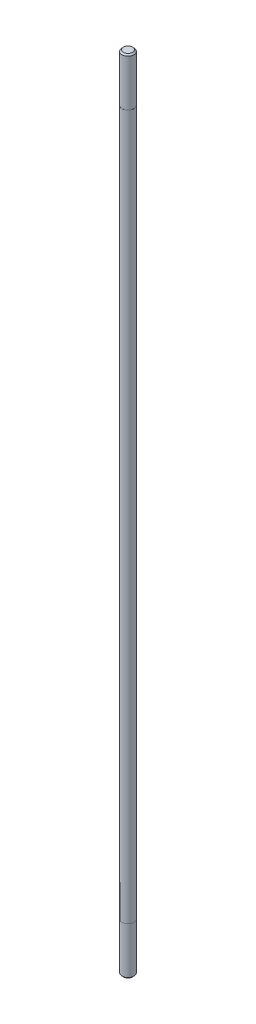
ISO-10303-21;
HEADER;
FILE_DESCRIPTION(('STEP AP214'),'2;1');
FILE_NAME('part.step','',(''),(''),'','','');
FILE_SCHEMA(('AUTOMOTIVE_DESIGN { 1 0 10303 214 1 1 1 1 }'));
ENDSEC;
DATA;
#1=APPLICATION_CONTEXT('core data for automotive mechanical design processes');
#2=APPLICATION_PROTOCOL_DEFINITION('international standard','automotive_design',2000,#1);
#3=PRODUCT_CONTEXT('',#1,'mechanical');
#4=PRODUCT('Part','Part','',(#3));
#5=PRODUCT_RELATED_PRODUCT_CATEGORY('part','',(#4));
#6=PRODUCT_DEFINITION_FORMATION('','',#4);
#7=PRODUCT_DEFINITION_CONTEXT('part definition',#1,'design');
#8=PRODUCT_DEFINITION('design','',#6,#7);
#9=PRODUCT_DEFINITION_SHAPE('','',#8);
#10=(LENGTH_UNIT() NAMED_UNIT(*) SI_UNIT(.MILLI.,.METRE.));
#11=(NAMED_UNIT(*) PLANE_ANGLE_UNIT() SI_UNIT($,.RADIAN.));
#12=(NAMED_UNIT(*) SI_UNIT($,.STERADIAN.) SOLID_ANGLE_UNIT());
#13=UNCERTAINTY_MEASURE_WITH_UNIT(LENGTH_MEASURE(1.E-05),#10,'distance_accuracy_value','');
#14=(GEOMETRIC_REPRESENTATION_CONTEXT(3) GLOBAL_UNCERTAINTY_ASSIGNED_CONTEXT((#13)) GLOBAL_UNIT_ASSIGNED_CONTEXT((#10,
#11,#12)) REPRESENTATION_CONTEXT('',''));
#15=CARTESIAN_POINT('',(0.,0.,0.));
#16=DIRECTION('',(0.,0.,1.));
#17=DIRECTION('',(1.,0.,0.));
#18=AXIS2_PLACEMENT_3D('',#15,#16,#17);
#19=CARTESIAN_POINT('',(0.,0.,0.));
#20=DIRECTION('',(0.,1.,0.));
#21=DIRECTION('',(0.,0.,1.));
#22=AXIS2_PLACEMENT_3D('',#19,#20,#21);
#23=PLANE('',#22);
#24=CARTESIAN_POINT('',(0.,0.,0.));
#25=DIRECTION('',(0.,1.,0.));
#26=DIRECTION('',(0.,0.,1.));
#27=AXIS2_PLACEMENT_3D('',#24,#25,#26);
#28=CIRCLE('',#27,1.5);
#29=CARTESIAN_POINT('',(0.,0.,1.5));
#30=VERTEX_POINT('',#29);
#31=EDGE_CURVE('E56',#30,#30,#28,.T.);
#32=ORIENTED_EDGE('',*,*,#31,.F.);
#33=EDGE_LOOP('',(#32));
#34=FACE_BOUND('',#33,.T.);
#35=CARTESIAN_POINT('',(0.,0.,0.));
#36=DIRECTION('',(0.,1.,0.));
#37=DIRECTION('',(0.,0.,1.));
#38=AXIS2_PLACEMENT_3D('',#35,#36,#37);
#39=CIRCLE('',#38,1.49);
#40=CARTESIAN_POINT('',(0.,0.,1.49));
#41=VERTEX_POINT('',#40);
#42=EDGE_CURVE('E50',#41,#41,#39,.F.);
#43=ORIENTED_EDGE('',*,*,#42,.F.);
#44=EDGE_LOOP('',(#43));
#45=FACE_BOUND('',#44,.T.);
#46=ADVANCED_FACE('F30',(#34,#45),#23,.F.);
#47=CARTESIAN_POINT('',(0.,176.,0.));
#48=DIRECTION('',(0.,1.,0.));
#49=DIRECTION('',(0.,0.,1.));
#50=AXIS2_PLACEMENT_3D('',#47,#48,#49);
#51=PLANE('',#50);
#52=CARTESIAN_POINT('',(0.,176.,0.));
#53=DIRECTION('',(0.,1.,0.));
#54=DIRECTION('',(0.,0.,1.));
#55=AXIS2_PLACEMENT_3D('',#52,#53,#54);
#56=CIRCLE('',#55,1.5);
#57=CARTESIAN_POINT('',(0.,176.,1.5));
#58=VERTEX_POINT('',#57);
#59=EDGE_CURVE('E53',#58,#58,#56,.T.);
#60=ORIENTED_EDGE('',*,*,#59,.T.);
#61=EDGE_LOOP('',(#60));
#62=FACE_BOUND('',#61,.T.);
#63=CARTESIAN_POINT('',(0.,176.,0.));
#64=DIRECTION('',(0.,1.,0.));
#65=DIRECTION('',(0.,0.,1.));
#66=AXIS2_PLACEMENT_3D('',#63,#64,#65);
#67=CIRCLE('',#66,1.49);
#68=CARTESIAN_POINT('',(0.,176.,1.49));
#69=VERTEX_POINT('',#68);
#70=EDGE_CURVE('E59',#69,#69,#67,.T.);
#71=ORIENTED_EDGE('',*,*,#70,.F.);
#72=EDGE_LOOP('',(#71));
#73=FACE_BOUND('',#72,.T.);
#74=ADVANCED_FACE('F65',(#62,#73),#51,.T.);
#75=CARTESIAN_POINT('',(0.,176.,0.));
#76=DIRECTION('',(0.,-1.,0.));
#77=DIRECTION('',(0.,0.,-1.));
#78=AXIS2_PLACEMENT_3D('',#75,#76,#77);
#79=CYLINDRICAL_SURFACE('',#78,1.5);
#80=ORIENTED_EDGE('',*,*,#59,.F.);
#81=EDGE_LOOP('',(#80));
#82=FACE_BOUND('',#81,.T.);
#83=ORIENTED_EDGE('',*,*,#31,.T.);
#84=EDGE_LOOP('',(#83));
#85=FACE_BOUND('',#84,.T.);
#86=ADVANCED_FACE('F32',(#82,#85),#79,.T.);
#87=CARTESIAN_POINT('',(0.,188.,0.));
#88=DIRECTION('',(0.,-1.,0.));
#89=DIRECTION('',(0.,0.,-1.));
#90=AXIS2_PLACEMENT_3D('',#87,#88,#89);
#91=CYLINDRICAL_SURFACE('',#90,1.49);
#92=CARTESIAN_POINT('',(0.,187.65,0.));
#93=DIRECTION('',(0.,1.,0.));
#94=DIRECTION('',(0.,0.,1.));
#95=AXIS2_PLACEMENT_3D('',#92,#93,#94);
#96=CIRCLE('',#95,1.49);
#97=CARTESIAN_POINT('',(0.,187.65,1.49));
#98=VERTEX_POINT('',#97);
#99=EDGE_CURVE('E41',#98,#98,#96,.F.);
#100=ORIENTED_EDGE('',*,*,#99,.T.);
#101=EDGE_LOOP('',(#100));
#102=FACE_BOUND('',#101,.T.);
#103=ORIENTED_EDGE('',*,*,#70,.T.);
#104=EDGE_LOOP('',(#103));
#105=FACE_BOUND('',#104,.T.);
#106=ADVANCED_FACE('F63',(#102,#105),#91,.T.);
#107=CARTESIAN_POINT('',(0.,188.,0.));
#108=DIRECTION('',(0.,1.,0.));
#109=DIRECTION('',(0.,0.,1.));
#110=AXIS2_PLACEMENT_3D('',#107,#108,#109);
#111=PLANE('',#110);
#112=CARTESIAN_POINT('',(0.,188.,0.));
#113=DIRECTION('',(0.,1.,0.));
#114=DIRECTION('',(0.,0.,1.));
#115=AXIS2_PLACEMENT_3D('',#112,#113,#114);
#116=CIRCLE('',#115,1.14);
#117=CARTESIAN_POINT('',(0.,188.,1.14));
#118=VERTEX_POINT('',#117);
#119=EDGE_CURVE('E45',#118,#118,#116,.T.);
#120=ORIENTED_EDGE('',*,*,#119,.T.);
#121=EDGE_LOOP('',(#120));
#122=FACE_BOUND('',#121,.T.);
#123=ADVANCED_FACE('F78',(#122),#111,.T.);
#124=CARTESIAN_POINT('',(0.,-12.,0.));
#125=DIRECTION('',(0.,1.,0.));
#126=DIRECTION('',(0.,0.,1.));
#127=AXIS2_PLACEMENT_3D('',#124,#125,#126);
#128=CYLINDRICAL_SURFACE('',#127,1.49);
#129=CARTESIAN_POINT('',(0.,-11.65,0.));
#130=DIRECTION('',(0.,-1.,0.));
#131=DIRECTION('',(0.,0.,-1.));
#132=AXIS2_PLACEMENT_3D('',#129,#130,#131);
#133=CIRCLE('',#132,1.49);
#134=CARTESIAN_POINT('',(0.,-11.65,-1.49));
#135=VERTEX_POINT('',#134);
#136=EDGE_CURVE('E10',#135,#135,#133,.F.);
#137=ORIENTED_EDGE('',*,*,#136,.T.);
#138=EDGE_LOOP('',(#137));
#139=FACE_BOUND('',#138,.T.);
#140=ORIENTED_EDGE('',*,*,#42,.T.);
#141=EDGE_LOOP('',(#140));
#142=FACE_BOUND('',#141,.T.);
#143=ADVANCED_FACE('F82',(#139,#142),#128,.T.);
#144=CARTESIAN_POINT('',(0.,-12.,0.));
#145=DIRECTION('',(0.,-1.,0.));
#146=DIRECTION('',(0.,0.,-1.));
#147=AXIS2_PLACEMENT_3D('',#144,#145,#146);
#148=PLANE('',#147);
#149=CARTESIAN_POINT('',(0.,-12.,0.));
#150=DIRECTION('',(0.,-1.,0.));
#151=DIRECTION('',(0.,0.,-1.));
#152=AXIS2_PLACEMENT_3D('',#149,#150,#151);
#153=CIRCLE('',#152,1.13999999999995);
#154=CARTESIAN_POINT('',(0.,-12.,-1.13999999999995));
#155=VERTEX_POINT('',#154);
#156=EDGE_CURVE('E37',#155,#155,#153,.T.);
#157=ORIENTED_EDGE('',*,*,#156,.T.);
#158=EDGE_LOOP('',(#157));
#159=FACE_BOUND('',#158,.T.);
#160=ADVANCED_FACE('F86',(#159),#148,.T.);
#161=CARTESIAN_POINT('',(0.,188.,0.));
#162=DIRECTION('',(0.,-1.,0.));
#163=DIRECTION('',(0.,0.,-1.));
#164=AXIS2_PLACEMENT_3D('',#161,#162,#163);
#165=CONICAL_SURFACE('',#164,1.14,0.785398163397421);
#166=ORIENTED_EDGE('',*,*,#99,.F.);
#167=EDGE_LOOP('',(#166));
#168=FACE_BOUND('',#167,.T.);
#169=ORIENTED_EDGE('',*,*,#119,.F.);
#170=EDGE_LOOP('',(#169));
#171=FACE_BOUND('',#170,.T.);
#172=ADVANCED_FACE('F89',(#168,#171),#165,.T.);
#173=CARTESIAN_POINT('',(0.,-12.,0.));
#174=DIRECTION('',(0.,1.,0.));
#175=DIRECTION('',(0.,0.,1.));
#176=AXIS2_PLACEMENT_3D('',#173,#174,#175);
#177=CONICAL_SURFACE('',#176,1.13999999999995,0.78539816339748);
#178=ORIENTED_EDGE('',*,*,#136,.F.);
#179=EDGE_LOOP('',(#178));
#180=FACE_BOUND('',#179,.T.);
#181=ORIENTED_EDGE('',*,*,#156,.F.);
#182=EDGE_LOOP('',(#181));
#183=FACE_BOUND('',#182,.T.);
#184=ADVANCED_FACE('F92',(#180,#183),#177,.T.);
#185=CLOSED_SHELL('',(#46,#74,#86,#106,#123,#143,#160,#172,#184));
#186=MANIFOLD_SOLID_BREP('B2',#185);
#187=ADVANCED_BREP_SHAPE_REPRESENTATION('',(#18,#186),#14);
#188=SHAPE_DEFINITION_REPRESENTATION(#9,#187);
ENDSEC;
END-ISO-10303-21;
